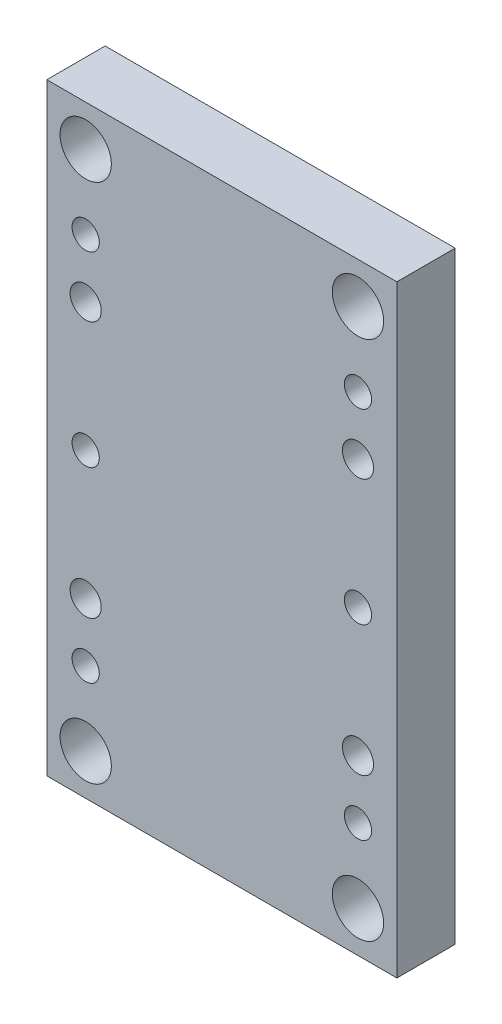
from build123d import *

# Parameters (mm, degrees)
ESQUISSE1_W             = 90
ESQUISSE1_H             = 156
ESQUISSE1_R             = 4.00375
ESQUISSE1_R_2           = 6.6
EXTRUSION1_DEPTH        = 15
TROU_TARAUD_M8X1_01_D   = 7
ESQUISSE4_OUTSIDE_W     = 128.144
ESQUISSE4_OUTSIDE_H     = 194.144
ESQUISSE4_OUTSIDE_W_2   = 90
ESQUISSE4_OUTSIDE_H_2   = 155
ENL_V_MAT_EXTRU_2_DEPTH = 92.290744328


with BuildPart() as part:
    # Esquisse1 → Extrusion1 (new body)
    with BuildSketch(Plane.XY):
        Rectangle(ESQUISSE1_W, ESQUISSE1_H)
        with Locations((35, 33)):
            Circle(ESQUISSE1_R, mode=Mode.SUBTRACT)
        with Locations((35, -33)):
            Circle(ESQUISSE1_R, mode=Mode.SUBTRACT)
        with Locations((35, 67)):
            Circle(ESQUISSE1_R_2, mode=Mode.SUBTRACT)
        with Locations((35, -67)):
            Circle(ESQUISSE1_R_2, mode=Mode.SUBTRACT)
        with Locations((-35, -33)):
            Circle(ESQUISSE1_R, mode=Mode.SUBTRACT)
        with Locations((-35, 33)):
            Circle(ESQUISSE1_R, mode=Mode.SUBTRACT)
        with Locations((-35, -67)):
            Circle(ESQUISSE1_R_2, mode=Mode.SUBTRACT)
        with Locations((-35, 67)):
            Circle(ESQUISSE1_R_2, mode=Mode.SUBTRACT)
    extrude(amount=EXTRUSION1_DEPTH)

    # Trou taraud_ M8x1.01 (through all)
    with Locations(Plane.XY.offset(15)):
        with Locations((-35, 0), (-35, -48), (35, -48), (-35, 48), (35, 48), (35, 0)):
            Hole(TROU_TARAUD_M8X1_01_D / 2)

    # Esquisse4 outside → Enl_v. mat.-Extru.2 (cut, through all)
    with BuildSketch(Plane.XY.offset(15)):
        Rectangle(ESQUISSE4_OUTSIDE_W, ESQUISSE4_OUTSIDE_H)
        Rectangle(ESQUISSE4_OUTSIDE_W_2, ESQUISSE4_OUTSIDE_H_2, mode=Mode.SUBTRACT)
    extrude(amount=-ENL_V_MAT_EXTRU_2_DEPTH, mode=Mode.SUBTRACT)


solid = part.part
